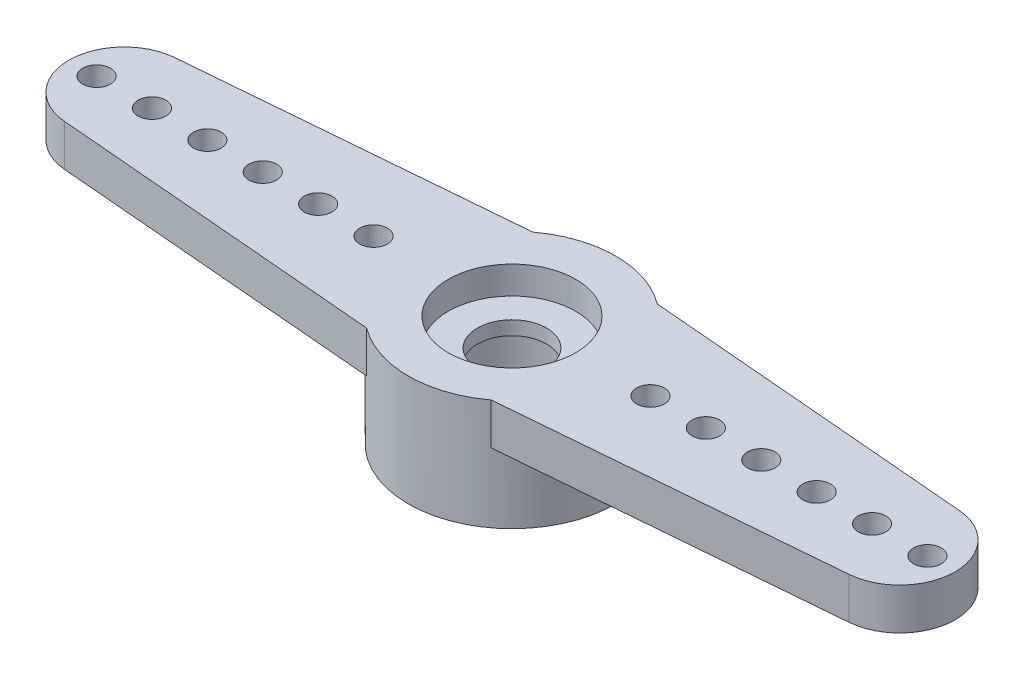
ISO-10303-21;
HEADER;
FILE_DESCRIPTION(('STEP AP214'),'2;1');
FILE_NAME('part.step','',(''),(''),'','','');
FILE_SCHEMA(('AUTOMOTIVE_DESIGN { 1 0 10303 214 1 1 1 1 }'));
ENDSEC;
DATA;
#1=APPLICATION_CONTEXT('core data for automotive mechanical design processes');
#2=APPLICATION_PROTOCOL_DEFINITION('international standard','automotive_design',2000,#1);
#3=PRODUCT_CONTEXT('',#1,'mechanical');
#4=PRODUCT('Part','Part','',(#3));
#5=PRODUCT_RELATED_PRODUCT_CATEGORY('part','',(#4));
#6=PRODUCT_DEFINITION_FORMATION('','',#4);
#7=PRODUCT_DEFINITION_CONTEXT('part definition',#1,'design');
#8=PRODUCT_DEFINITION('design','',#6,#7);
#9=PRODUCT_DEFINITION_SHAPE('','',#8);
#10=(LENGTH_UNIT() NAMED_UNIT(*) SI_UNIT(.MILLI.,.METRE.));
#11=(NAMED_UNIT(*) PLANE_ANGLE_UNIT() SI_UNIT($,.RADIAN.));
#12=(NAMED_UNIT(*) SI_UNIT($,.STERADIAN.) SOLID_ANGLE_UNIT());
#13=UNCERTAINTY_MEASURE_WITH_UNIT(LENGTH_MEASURE(1.E-05),#10,'distance_accuracy_value','');
#14=(GEOMETRIC_REPRESENTATION_CONTEXT(3) GLOBAL_UNCERTAINTY_ASSIGNED_CONTEXT((#13)) GLOBAL_UNIT_ASSIGNED_CONTEXT((#10,
#11,#12)) REPRESENTATION_CONTEXT('',''));
#15=CARTESIAN_POINT('',(0.,0.,0.));
#16=DIRECTION('',(0.,0.,1.));
#17=DIRECTION('',(1.,0.,0.));
#18=AXIS2_PLACEMENT_3D('',#15,#16,#17);
#19=CARTESIAN_POINT('',(0.,-1.5,0.));
#20=DIRECTION('',(0.,1.,0.));
#21=DIRECTION('',(0.,0.,1.));
#22=AXIS2_PLACEMENT_3D('',#19,#20,#21);
#23=CYLINDRICAL_SURFACE('',#22,1.25);
#24=CARTESIAN_POINT('',(0.,3.,0.));
#25=DIRECTION('',(0.,1.,0.));
#26=DIRECTION('',(0.,0.,1.));
#27=AXIS2_PLACEMENT_3D('',#24,#25,#26);
#28=CIRCLE('',#27,1.25);
#29=CARTESIAN_POINT('',(0.,3.,1.25));
#30=VERTEX_POINT('',#29);
#31=EDGE_CURVE('E511',#30,#30,#28,.T.);
#32=ORIENTED_EDGE('',*,*,#31,.T.);
#33=EDGE_LOOP('',(#32));
#34=FACE_BOUND('',#33,.T.);
#35=CARTESIAN_POINT('',(0.,2.5,0.));
#36=DIRECTION('',(0.,-1.,0.));
#37=DIRECTION('',(0.,0.,-1.));
#38=AXIS2_PLACEMENT_3D('',#35,#36,#37);
#39=CIRCLE('',#38,1.25);
#40=CARTESIAN_POINT('',(0.,2.5,-1.25));
#41=VERTEX_POINT('',#40);
#42=EDGE_CURVE('E37',#41,#41,#39,.F.);
#43=ORIENTED_EDGE('',*,*,#42,.F.);
#44=EDGE_LOOP('',(#43));
#45=FACE_BOUND('',#44,.T.);
#46=ADVANCED_FACE('F33',(#34,#45),#23,.F.);
#47=CARTESIAN_POINT('',(0.,4.,0.));
#48=DIRECTION('',(0.,-1.,0.));
#49=DIRECTION('',(0.,0.,-1.));
#50=AXIS2_PLACEMENT_3D('',#47,#48,#49);
#51=CYLINDRICAL_SURFACE('',#50,3.75);
#52=CARTESIAN_POINT('',(0.,4.,0.));
#53=DIRECTION('',(0.,1.,0.));
#54=DIRECTION('',(0.,0.,1.));
#55=AXIS2_PLACEMENT_3D('',#52,#53,#54);
#56=CIRCLE('',#55,3.75);
#57=CARTESIAN_POINT('',(2.25,4.,-3.));
#58=VERTEX_POINT('',#57);
#59=CARTESIAN_POINT('',(-2.25,4.,-3.));
#60=VERTEX_POINT('',#59);
#61=EDGE_CURVE('E42',#58,#60,#56,.T.);
#62=ORIENTED_EDGE('',*,*,#61,.F.);
#63=DIRECTION('',(0.,1.,0.));
#64=VECTOR('',#63,1.);
#65=CARTESIAN_POINT('',(2.25,2.5,-3.));
#66=LINE('',#65,#64);
#67=CARTESIAN_POINT('',(2.25,2.5,-3.));
#68=VERTEX_POINT('',#67);
#69=EDGE_CURVE('E125',#68,#58,#66,.T.);
#70=ORIENTED_EDGE('',*,*,#69,.F.);
#71=CARTESIAN_POINT('',(0.,2.5,0.));
#72=DIRECTION('',(0.,-1.,0.));
#73=DIRECTION('',(0.,0.,-1.));
#74=AXIS2_PLACEMENT_3D('',#71,#72,#73);
#75=CIRCLE('',#74,3.75);
#76=CARTESIAN_POINT('',(2.25,2.5,3.));
#77=VERTEX_POINT('',#76);
#78=EDGE_CURVE('E117',#68,#77,#75,.T.);
#79=ORIENTED_EDGE('',*,*,#78,.T.);
#80=DIRECTION('',(0.,1.,0.));
#81=VECTOR('',#80,1.);
#82=CARTESIAN_POINT('',(2.25,2.5,3.));
#83=LINE('',#82,#81);
#84=CARTESIAN_POINT('',(2.25,4.,3.));
#85=VERTEX_POINT('',#84);
#86=EDGE_CURVE('E101',#77,#85,#83,.T.);
#87=ORIENTED_EDGE('',*,*,#86,.T.);
#88=CARTESIAN_POINT('',(-2.25,4.,3.));
#89=VERTEX_POINT('',#88);
#90=EDGE_CURVE('E11',#89,#85,#56,.T.);
#91=ORIENTED_EDGE('',*,*,#90,.F.);
#92=DIRECTION('',(0.,1.,0.));
#93=VECTOR('',#92,1.);
#94=CARTESIAN_POINT('',(-2.25,2.5,3.));
#95=LINE('',#94,#93);
#96=CARTESIAN_POINT('',(-2.25,2.5,3.));
#97=VERTEX_POINT('',#96);
#98=EDGE_CURVE('E203',#97,#89,#95,.T.);
#99=ORIENTED_EDGE('',*,*,#98,.F.);
#100=CARTESIAN_POINT('',(0.,2.5,0.));
#101=DIRECTION('',(0.,-1.,0.));
#102=DIRECTION('',(0.,0.,1.));
#103=AXIS2_PLACEMENT_3D('',#100,#101,#102);
#104=CIRCLE('',#103,3.75);
#105=CARTESIAN_POINT('',(-2.25,2.5,-3.));
#106=VERTEX_POINT('',#105);
#107=EDGE_CURVE('E186',#97,#106,#104,.T.);
#108=ORIENTED_EDGE('',*,*,#107,.T.);
#109=DIRECTION('',(0.,1.,0.));
#110=VECTOR('',#109,1.);
#111=CARTESIAN_POINT('',(-2.25,2.5,-3.));
#112=LINE('',#111,#110);
#113=EDGE_CURVE('E200',#106,#60,#112,.T.);
#114=ORIENTED_EDGE('',*,*,#113,.T.);
#115=EDGE_LOOP('',(#62,#70,#79,#87,#91,#99,#108,#114));
#116=FACE_BOUND('',#115,.T.);
#117=CARTESIAN_POINT('',(0.,0.,0.));
#118=DIRECTION('',(0.,1.,0.));
#119=DIRECTION('',(0.,0.,1.));
#120=AXIS2_PLACEMENT_3D('',#117,#118,#119);
#121=CIRCLE('',#120,3.75);
#122=CARTESIAN_POINT('',(0.,0.,3.75));
#123=VERTEX_POINT('',#122);
#124=EDGE_CURVE('E209',#123,#123,#121,.T.);
#125=ORIENTED_EDGE('',*,*,#124,.T.);
#126=EDGE_LOOP('',(#125));
#127=FACE_BOUND('',#126,.T.);
#128=ADVANCED_FACE('F35',(#116,#127),#51,.T.);
#129=CARTESIAN_POINT('',(0.,4.,0.));
#130=DIRECTION('',(0.,1.,0.));
#131=DIRECTION('',(0.,0.,1.));
#132=AXIS2_PLACEMENT_3D('',#129,#130,#131);
#133=PLANE('',#132);
#134=CARTESIAN_POINT('',(0.,4.,0.));
#135=DIRECTION('',(0.,1.,0.));
#136=DIRECTION('',(0.,0.,1.));
#137=AXIS2_PLACEMENT_3D('',#134,#135,#136);
#138=CIRCLE('',#137,2.3);
#139=CARTESIAN_POINT('',(0.,4.,2.3));
#140=VERTEX_POINT('',#139);
#141=EDGE_CURVE('E199',#140,#140,#138,.T.);
#142=ORIENTED_EDGE('',*,*,#141,.F.);
#143=EDGE_LOOP('',(#142));
#144=FACE_BOUND('',#143,.T.);
#145=ORIENTED_EDGE('',*,*,#90,.T.);
#146=DIRECTION('',(0.996448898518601,0.,-0.0841997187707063));
#147=VECTOR('',#146,1.);
#148=CARTESIAN_POINT('',(14.1683994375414,4.,1.9928977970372));
#149=LINE('',#148,#147);
#150=CARTESIAN_POINT('',(14.1683994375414,4.,1.99289779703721));
#151=VERTEX_POINT('',#150);
#152=EDGE_CURVE('E106',#85,#151,#149,.T.);
#153=ORIENTED_EDGE('',*,*,#152,.T.);
#154=CARTESIAN_POINT('',(14.,4.,0.));
#155=DIRECTION('',(0.,1.,0.));
#156=DIRECTION('',(0.,0.,-1.));
#157=AXIS2_PLACEMENT_3D('',#154,#155,#156);
#158=CIRCLE('',#157,2.);
#159=CARTESIAN_POINT('',(14.1683994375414,4.,-1.9928977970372));
#160=VERTEX_POINT('',#159);
#161=EDGE_CURVE('E127',#151,#160,#158,.T.);
#162=ORIENTED_EDGE('',*,*,#161,.T.);
#163=DIRECTION('',(-0.996448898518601,0.,-0.0841997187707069));
#164=VECTOR('',#163,1.);
#165=CARTESIAN_POINT('',(14.1683994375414,4.,-1.9928977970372));
#166=LINE('',#165,#164);
#167=EDGE_CURVE('E50',#160,#58,#166,.T.);
#168=ORIENTED_EDGE('',*,*,#167,.T.);
#169=ORIENTED_EDGE('',*,*,#61,.T.);
#170=DIRECTION('',(-0.996448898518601,0.,0.0841997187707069));
#171=VECTOR('',#170,1.);
#172=CARTESIAN_POINT('',(-14.1683994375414,4.,-1.9928977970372));
#173=LINE('',#172,#171);
#174=CARTESIAN_POINT('',(-14.1683994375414,4.,-1.9928977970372));
#175=VERTEX_POINT('',#174);
#176=EDGE_CURVE('E183',#60,#175,#173,.T.);
#177=ORIENTED_EDGE('',*,*,#176,.T.);
#178=CARTESIAN_POINT('',(-14.,4.,0.));
#179=DIRECTION('',(0.,1.,0.));
#180=DIRECTION('',(0.,0.,1.));
#181=AXIS2_PLACEMENT_3D('',#178,#179,#180);
#182=CIRCLE('',#181,2.);
#183=CARTESIAN_POINT('',(-14.1683994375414,4.,1.9928977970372));
#184=VERTEX_POINT('',#183);
#185=EDGE_CURVE('E176',#175,#184,#182,.T.);
#186=ORIENTED_EDGE('',*,*,#185,.T.);
#187=DIRECTION('',(0.996448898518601,0.,0.0841997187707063));
#188=VECTOR('',#187,1.);
#189=CARTESIAN_POINT('',(-14.1683994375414,4.,1.9928977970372));
#190=LINE('',#189,#188);
#191=EDGE_CURVE('E56',#184,#89,#190,.T.);
#192=ORIENTED_EDGE('',*,*,#191,.T.);
#193=EDGE_LOOP('',(#145,#153,#162,#168,#169,#177,#186,#192));
#194=FACE_BOUND('',#193,.T.);
#195=CARTESIAN_POINT('',(-5.,4.,0.));
#196=DIRECTION('',(0.,1.,0.));
#197=DIRECTION('',(0.,0.,1.));
#198=AXIS2_PLACEMENT_3D('',#195,#196,#197);
#199=CIRCLE('',#198,0.500000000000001);
#200=CARTESIAN_POINT('',(-5.,4.,0.500000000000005));
#201=VERTEX_POINT('',#200);
#202=EDGE_CURVE('E139',#201,#201,#199,.T.);
#203=ORIENTED_EDGE('',*,*,#202,.F.);
#204=EDGE_LOOP('',(#203));
#205=FACE_BOUND('',#204,.T.);
#206=CARTESIAN_POINT('',(-7.,4.,0.));
#207=DIRECTION('',(0.,1.,0.));
#208=DIRECTION('',(0.,0.,1.));
#209=AXIS2_PLACEMENT_3D('',#206,#207,#208);
#210=CIRCLE('',#209,0.500000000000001);
#211=CARTESIAN_POINT('',(-7.,4.,0.500000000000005));
#212=VERTEX_POINT('',#211);
#213=EDGE_CURVE('E146',#212,#212,#210,.T.);
#214=ORIENTED_EDGE('',*,*,#213,.F.);
#215=EDGE_LOOP('',(#214));
#216=FACE_BOUND('',#215,.T.);
#217=CARTESIAN_POINT('',(-9.,4.,0.));
#218=DIRECTION('',(0.,1.,0.));
#219=DIRECTION('',(0.,0.,1.));
#220=AXIS2_PLACEMENT_3D('',#217,#218,#219);
#221=CIRCLE('',#220,0.500000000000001);
#222=CARTESIAN_POINT('',(-9.,4.,0.500000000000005));
#223=VERTEX_POINT('',#222);
#224=EDGE_CURVE('E152',#223,#223,#221,.T.);
#225=ORIENTED_EDGE('',*,*,#224,.F.);
#226=EDGE_LOOP('',(#225));
#227=FACE_BOUND('',#226,.T.);
#228=CARTESIAN_POINT('',(-11.,4.,0.));
#229=DIRECTION('',(0.,1.,0.));
#230=DIRECTION('',(0.,0.,1.));
#231=AXIS2_PLACEMENT_3D('',#228,#229,#230);
#232=CIRCLE('',#231,0.500000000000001);
#233=CARTESIAN_POINT('',(-11.,4.,0.500000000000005));
#234=VERTEX_POINT('',#233);
#235=EDGE_CURVE('E158',#234,#234,#232,.T.);
#236=ORIENTED_EDGE('',*,*,#235,.F.);
#237=EDGE_LOOP('',(#236));
#238=FACE_BOUND('',#237,.T.);
#239=CARTESIAN_POINT('',(-13.,4.,0.));
#240=DIRECTION('',(0.,1.,0.));
#241=DIRECTION('',(0.,0.,1.));
#242=AXIS2_PLACEMENT_3D('',#239,#240,#241);
#243=CIRCLE('',#242,0.500000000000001);
#244=CARTESIAN_POINT('',(-13.,4.,0.500000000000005));
#245=VERTEX_POINT('',#244);
#246=EDGE_CURVE('E164',#245,#245,#243,.T.);
#247=ORIENTED_EDGE('',*,*,#246,.F.);
#248=EDGE_LOOP('',(#247));
#249=FACE_BOUND('',#248,.T.);
#250=CARTESIAN_POINT('',(-15.,4.,0.));
#251=DIRECTION('',(0.,1.,0.));
#252=DIRECTION('',(0.,0.,1.));
#253=AXIS2_PLACEMENT_3D('',#250,#251,#252);
#254=CIRCLE('',#253,0.500000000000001);
#255=CARTESIAN_POINT('',(-15.,4.,0.500000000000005));
#256=VERTEX_POINT('',#255);
#257=EDGE_CURVE('E170',#256,#256,#254,.T.);
#258=ORIENTED_EDGE('',*,*,#257,.F.);
#259=EDGE_LOOP('',(#258));
#260=FACE_BOUND('',#259,.T.);
#261=CARTESIAN_POINT('',(13.,4.,0.));
#262=DIRECTION('',(0.,1.,0.));
#263=DIRECTION('',(0.,0.,-1.));
#264=AXIS2_PLACEMENT_3D('',#261,#262,#263);
#265=CIRCLE('',#264,0.500000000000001);
#266=CARTESIAN_POINT('',(13.,4.,-0.499999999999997));
#267=VERTEX_POINT('',#266);
#268=EDGE_CURVE('E513',#267,#267,#265,.T.);
#269=ORIENTED_EDGE('',*,*,#268,.F.);
#270=EDGE_LOOP('',(#269));
#271=FACE_BOUND('',#270,.T.);
#272=CARTESIAN_POINT('',(11.,4.,0.));
#273=DIRECTION('',(0.,1.,0.));
#274=DIRECTION('',(0.,0.,-1.));
#275=AXIS2_PLACEMENT_3D('',#272,#273,#274);
#276=CIRCLE('',#275,0.500000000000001);
#277=CARTESIAN_POINT('',(11.,4.,-0.499999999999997));
#278=VERTEX_POINT('',#277);
#279=EDGE_CURVE('E517',#278,#278,#276,.T.);
#280=ORIENTED_EDGE('',*,*,#279,.F.);
#281=EDGE_LOOP('',(#280));
#282=FACE_BOUND('',#281,.T.);
#283=CARTESIAN_POINT('',(9.,4.,0.));
#284=DIRECTION('',(0.,1.,0.));
#285=DIRECTION('',(0.,0.,-1.));
#286=AXIS2_PLACEMENT_3D('',#283,#284,#285);
#287=CIRCLE('',#286,0.500000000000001);
#288=CARTESIAN_POINT('',(9.,4.,-0.499999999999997));
#289=VERTEX_POINT('',#288);
#290=EDGE_CURVE('E523',#289,#289,#287,.T.);
#291=ORIENTED_EDGE('',*,*,#290,.F.);
#292=EDGE_LOOP('',(#291));
#293=FACE_BOUND('',#292,.T.);
#294=CARTESIAN_POINT('',(7.,4.,0.));
#295=DIRECTION('',(0.,1.,0.));
#296=DIRECTION('',(0.,0.,-1.));
#297=AXIS2_PLACEMENT_3D('',#294,#295,#296);
#298=CIRCLE('',#297,0.500000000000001);
#299=CARTESIAN_POINT('',(7.,4.,-0.499999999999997));
#300=VERTEX_POINT('',#299);
#301=EDGE_CURVE('E529',#300,#300,#298,.T.);
#302=ORIENTED_EDGE('',*,*,#301,.F.);
#303=EDGE_LOOP('',(#302));
#304=FACE_BOUND('',#303,.T.);
#305=CARTESIAN_POINT('',(5.,4.,0.));
#306=DIRECTION('',(0.,1.,0.));
#307=DIRECTION('',(0.,0.,-1.));
#308=AXIS2_PLACEMENT_3D('',#305,#306,#307);
#309=CIRCLE('',#308,0.500000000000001);
#310=CARTESIAN_POINT('',(5.,4.,-0.499999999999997));
#311=VERTEX_POINT('',#310);
#312=EDGE_CURVE('E535',#311,#311,#309,.T.);
#313=ORIENTED_EDGE('',*,*,#312,.F.);
#314=EDGE_LOOP('',(#313));
#315=FACE_BOUND('',#314,.T.);
#316=CARTESIAN_POINT('',(15.,4.,0.));
#317=DIRECTION('',(0.,1.,0.));
#318=DIRECTION('',(0.,0.,-1.));
#319=AXIS2_PLACEMENT_3D('',#316,#317,#318);
#320=CIRCLE('',#319,0.500000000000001);
#321=CARTESIAN_POINT('',(15.,4.,-0.499999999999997));
#322=VERTEX_POINT('',#321);
#323=EDGE_CURVE('E130',#322,#322,#320,.T.);
#324=ORIENTED_EDGE('',*,*,#323,.F.);
#325=EDGE_LOOP('',(#324));
#326=FACE_BOUND('',#325,.T.);
#327=ADVANCED_FACE('F214',(#144,#194,#205,#216,#227,#238,#249,#260,#271,#282,#293,#304,#315,
#326),#133,.T.);
#328=CARTESIAN_POINT('',(0.,0.,0.));
#329=DIRECTION('',(0.,1.,0.));
#330=DIRECTION('',(0.,0.,1.));
#331=AXIS2_PLACEMENT_3D('',#328,#329,#330);
#332=PLANE('',#331);
#333=CARTESIAN_POINT('',(0.,0.,0.));
#334=DIRECTION('',(0.,-1.,0.));
#335=DIRECTION('',(0.,0.,-1.));
#336=AXIS2_PLACEMENT_3D('',#333,#334,#335);
#337=CIRCLE('',#336,2.3);
#338=CARTESIAN_POINT('',(0.,0.,-2.3));
#339=VERTEX_POINT('',#338);
#340=EDGE_CURVE('E504',#339,#339,#337,.T.);
#341=ORIENTED_EDGE('',*,*,#340,.F.);
#342=EDGE_LOOP('',(#341));
#343=FACE_BOUND('',#342,.T.);
#344=ORIENTED_EDGE('',*,*,#124,.F.);
#345=EDGE_LOOP('',(#344));
#346=FACE_BOUND('',#345,.T.);
#347=ADVANCED_FACE('F464',(#343,#346),#332,.F.);
#348=CARTESIAN_POINT('',(0.,3.,0.));
#349=DIRECTION('',(0.,1.,0.));
#350=DIRECTION('',(0.,0.,1.));
#351=AXIS2_PLACEMENT_3D('',#348,#349,#350);
#352=CYLINDRICAL_SURFACE('',#351,2.3);
#353=CARTESIAN_POINT('',(0.,3.,0.));
#354=DIRECTION('',(0.,1.,0.));
#355=DIRECTION('',(0.,0.,1.));
#356=AXIS2_PLACEMENT_3D('',#353,#354,#355);
#357=CIRCLE('',#356,2.3);
#358=CARTESIAN_POINT('',(0.,3.,2.3));
#359=VERTEX_POINT('',#358);
#360=EDGE_CURVE('E206',#359,#359,#357,.T.);
#361=ORIENTED_EDGE('',*,*,#360,.F.);
#362=EDGE_LOOP('',(#361));
#363=FACE_BOUND('',#362,.T.);
#364=ORIENTED_EDGE('',*,*,#141,.T.);
#365=EDGE_LOOP('',(#364));
#366=FACE_BOUND('',#365,.T.);
#367=ADVANCED_FACE('F237',(#363,#366),#352,.F.);
#368=CARTESIAN_POINT('',(0.,3.,0.));
#369=DIRECTION('',(0.,1.,0.));
#370=DIRECTION('',(0.,0.,1.));
#371=AXIS2_PLACEMENT_3D('',#368,#369,#370);
#372=PLANE('',#371);
#373=ORIENTED_EDGE('',*,*,#31,.F.);
#374=EDGE_LOOP('',(#373));
#375=FACE_BOUND('',#374,.T.);
#376=ORIENTED_EDGE('',*,*,#360,.T.);
#377=EDGE_LOOP('',(#376));
#378=FACE_BOUND('',#377,.T.);
#379=ADVANCED_FACE('F230',(#375,#378),#372,.T.);
#380=CARTESIAN_POINT('',(-14.,2.5,0.));
#381=DIRECTION('',(0.,1.,0.));
#382=DIRECTION('',(0.,0.,1.));
#383=AXIS2_PLACEMENT_3D('',#380,#381,#382);
#384=CYLINDRICAL_SURFACE('',#383,2.);
#385=ORIENTED_EDGE('',*,*,#185,.F.);
#386=DIRECTION('',(0.,1.,0.));
#387=VECTOR('',#386,1.);
#388=CARTESIAN_POINT('',(-14.1683994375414,2.5,-1.9928977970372));
#389=LINE('',#388,#387);
#390=CARTESIAN_POINT('',(-14.1683994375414,2.5,-1.9928977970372));
#391=VERTEX_POINT('',#390);
#392=EDGE_CURVE('E197',#391,#175,#389,.T.);
#393=ORIENTED_EDGE('',*,*,#392,.F.);
#394=CARTESIAN_POINT('',(-14.,2.5,0.));
#395=DIRECTION('',(0.,1.,0.));
#396=DIRECTION('',(0.,0.,1.));
#397=AXIS2_PLACEMENT_3D('',#394,#395,#396);
#398=CIRCLE('',#397,2.);
#399=CARTESIAN_POINT('',(-14.1683994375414,2.5,1.9928977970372));
#400=VERTEX_POINT('',#399);
#401=EDGE_CURVE('E179',#391,#400,#398,.T.);
#402=ORIENTED_EDGE('',*,*,#401,.T.);
#403=DIRECTION('',(0.,1.,0.));
#404=VECTOR('',#403,1.);
#405=CARTESIAN_POINT('',(-14.1683994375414,2.5,1.9928977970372));
#406=LINE('',#405,#404);
#407=EDGE_CURVE('E192',#400,#184,#406,.T.);
#408=ORIENTED_EDGE('',*,*,#407,.T.);
#409=EDGE_LOOP('',(#385,#393,#402,#408));
#410=FACE_BOUND('',#409,.T.);
#411=ADVANCED_FACE('F228',(#410),#384,.T.);
#412=CARTESIAN_POINT('',(-14.1683994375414,2.5,-1.9928977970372));
#413=DIRECTION('',(-0.0841997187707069,0.,-0.996448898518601));
#414=DIRECTION('',(-0.996448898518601,0.,0.0841997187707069));
#415=AXIS2_PLACEMENT_3D('',#412,#413,#414);
#416=PLANE('',#415);
#417=ORIENTED_EDGE('',*,*,#176,.F.);
#418=ORIENTED_EDGE('',*,*,#113,.F.);
#419=DIRECTION('',(-0.996448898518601,0.,0.0841997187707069));
#420=VECTOR('',#419,1.);
#421=CARTESIAN_POINT('',(-14.1683994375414,2.5,-1.9928977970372));
#422=LINE('',#421,#420);
#423=EDGE_CURVE('E189',#106,#391,#422,.T.);
#424=ORIENTED_EDGE('',*,*,#423,.T.);
#425=ORIENTED_EDGE('',*,*,#392,.T.);
#426=EDGE_LOOP('',(#417,#418,#424,#425));
#427=FACE_BOUND('',#426,.T.);
#428=ADVANCED_FACE('F217',(#427),#416,.T.);
#429=CARTESIAN_POINT('',(-14.1683994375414,2.5,1.9928977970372));
#430=DIRECTION('',(-0.0841997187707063,0.,0.996448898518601));
#431=DIRECTION('',(0.996448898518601,0.,0.0841997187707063));
#432=AXIS2_PLACEMENT_3D('',#429,#430,#431);
#433=PLANE('',#432);
#434=ORIENTED_EDGE('',*,*,#191,.F.);
#435=ORIENTED_EDGE('',*,*,#407,.F.);
#436=DIRECTION('',(0.996448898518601,0.,0.0841997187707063));
#437=VECTOR('',#436,1.);
#438=CARTESIAN_POINT('',(-14.1683994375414,2.5,1.9928977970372));
#439=LINE('',#438,#437);
#440=EDGE_CURVE('E182',#400,#97,#439,.T.);
#441=ORIENTED_EDGE('',*,*,#440,.T.);
#442=ORIENTED_EDGE('',*,*,#98,.T.);
#443=EDGE_LOOP('',(#434,#435,#441,#442));
#444=FACE_BOUND('',#443,.T.);
#445=ADVANCED_FACE('F226',(#444),#433,.T.);
#446=CARTESIAN_POINT('',(-14.,2.5,0.));
#447=DIRECTION('',(0.,1.,0.));
#448=DIRECTION('',(0.,0.,1.));
#449=AXIS2_PLACEMENT_3D('',#446,#447,#448);
#450=PLANE('',#449);
#451=CARTESIAN_POINT('',(-5.,2.5,0.));
#452=DIRECTION('',(0.,1.,0.));
#453=DIRECTION('',(0.,0.,1.));
#454=AXIS2_PLACEMENT_3D('',#451,#452,#453);
#455=CIRCLE('',#454,0.500000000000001);
#456=CARTESIAN_POINT('',(-5.,2.5,0.500000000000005));
#457=VERTEX_POINT('',#456);
#458=EDGE_CURVE('E143',#457,#457,#455,.T.);
#459=ORIENTED_EDGE('',*,*,#458,.T.);
#460=EDGE_LOOP('',(#459));
#461=FACE_BOUND('',#460,.T.);
#462=CARTESIAN_POINT('',(-7.,2.5,0.));
#463=DIRECTION('',(0.,1.,0.));
#464=DIRECTION('',(0.,0.,1.));
#465=AXIS2_PLACEMENT_3D('',#462,#463,#464);
#466=CIRCLE('',#465,0.500000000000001);
#467=CARTESIAN_POINT('',(-7.,2.5,0.500000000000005));
#468=VERTEX_POINT('',#467);
#469=EDGE_CURVE('E149',#468,#468,#466,.T.);
#470=ORIENTED_EDGE('',*,*,#469,.T.);
#471=EDGE_LOOP('',(#470));
#472=FACE_BOUND('',#471,.T.);
#473=CARTESIAN_POINT('',(-9.,2.5,0.));
#474=DIRECTION('',(0.,1.,0.));
#475=DIRECTION('',(0.,0.,1.));
#476=AXIS2_PLACEMENT_3D('',#473,#474,#475);
#477=CIRCLE('',#476,0.500000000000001);
#478=CARTESIAN_POINT('',(-9.,2.5,0.500000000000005));
#479=VERTEX_POINT('',#478);
#480=EDGE_CURVE('E155',#479,#479,#477,.T.);
#481=ORIENTED_EDGE('',*,*,#480,.T.);
#482=EDGE_LOOP('',(#481));
#483=FACE_BOUND('',#482,.T.);
#484=CARTESIAN_POINT('',(-11.,2.5,0.));
#485=DIRECTION('',(0.,1.,0.));
#486=DIRECTION('',(0.,0.,1.));
#487=AXIS2_PLACEMENT_3D('',#484,#485,#486);
#488=CIRCLE('',#487,0.500000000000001);
#489=CARTESIAN_POINT('',(-11.,2.5,0.500000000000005));
#490=VERTEX_POINT('',#489);
#491=EDGE_CURVE('E161',#490,#490,#488,.T.);
#492=ORIENTED_EDGE('',*,*,#491,.T.);
#493=EDGE_LOOP('',(#492));
#494=FACE_BOUND('',#493,.T.);
#495=CARTESIAN_POINT('',(-13.,2.5,0.));
#496=DIRECTION('',(0.,1.,0.));
#497=DIRECTION('',(0.,0.,1.));
#498=AXIS2_PLACEMENT_3D('',#495,#496,#497);
#499=CIRCLE('',#498,0.500000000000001);
#500=CARTESIAN_POINT('',(-13.,2.5,0.500000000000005));
#501=VERTEX_POINT('',#500);
#502=EDGE_CURVE('E167',#501,#501,#499,.T.);
#503=ORIENTED_EDGE('',*,*,#502,.T.);
#504=EDGE_LOOP('',(#503));
#505=FACE_BOUND('',#504,.T.);
#506=CARTESIAN_POINT('',(-15.,2.5,0.));
#507=DIRECTION('',(0.,1.,0.));
#508=DIRECTION('',(0.,0.,1.));
#509=AXIS2_PLACEMENT_3D('',#506,#507,#508);
#510=CIRCLE('',#509,0.500000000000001);
#511=CARTESIAN_POINT('',(-15.,2.5,0.500000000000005));
#512=VERTEX_POINT('',#511);
#513=EDGE_CURVE('E173',#512,#512,#510,.T.);
#514=ORIENTED_EDGE('',*,*,#513,.T.);
#515=EDGE_LOOP('',(#514));
#516=FACE_BOUND('',#515,.T.);
#517=ORIENTED_EDGE('',*,*,#401,.F.);
#518=ORIENTED_EDGE('',*,*,#423,.F.);
#519=ORIENTED_EDGE('',*,*,#107,.F.);
#520=ORIENTED_EDGE('',*,*,#440,.F.);
#521=EDGE_LOOP('',(#517,#518,#519,#520));
#522=FACE_BOUND('',#521,.T.);
#523=ADVANCED_FACE('F224',(#461,#472,#483,#494,#505,#516,#522),#450,.F.);
#524=CARTESIAN_POINT('',(-15.,2.5,0.));
#525=DIRECTION('',(0.,1.,0.));
#526=DIRECTION('',(0.,0.,1.));
#527=AXIS2_PLACEMENT_3D('',#524,#525,#526);
#528=CYLINDRICAL_SURFACE('',#527,0.500000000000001);
#529=ORIENTED_EDGE('',*,*,#513,.F.);
#530=EDGE_LOOP('',(#529));
#531=FACE_BOUND('',#530,.T.);
#532=ORIENTED_EDGE('',*,*,#257,.T.);
#533=EDGE_LOOP('',(#532));
#534=FACE_BOUND('',#533,.T.);
#535=ADVANCED_FACE('F310',(#531,#534),#528,.F.);
#536=CARTESIAN_POINT('',(-13.,2.5,0.));
#537=DIRECTION('',(0.,1.,0.));
#538=DIRECTION('',(0.,0.,1.));
#539=AXIS2_PLACEMENT_3D('',#536,#537,#538);
#540=CYLINDRICAL_SURFACE('',#539,0.500000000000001);
#541=ORIENTED_EDGE('',*,*,#502,.F.);
#542=EDGE_LOOP('',(#541));
#543=FACE_BOUND('',#542,.T.);
#544=ORIENTED_EDGE('',*,*,#246,.T.);
#545=EDGE_LOOP('',(#544));
#546=FACE_BOUND('',#545,.T.);
#547=ADVANCED_FACE('F306',(#543,#546),#540,.F.);
#548=CARTESIAN_POINT('',(-11.,2.5,0.));
#549=DIRECTION('',(0.,1.,0.));
#550=DIRECTION('',(0.,0.,1.));
#551=AXIS2_PLACEMENT_3D('',#548,#549,#550);
#552=CYLINDRICAL_SURFACE('',#551,0.500000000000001);
#553=ORIENTED_EDGE('',*,*,#491,.F.);
#554=EDGE_LOOP('',(#553));
#555=FACE_BOUND('',#554,.T.);
#556=ORIENTED_EDGE('',*,*,#235,.T.);
#557=EDGE_LOOP('',(#556));
#558=FACE_BOUND('',#557,.T.);
#559=ADVANCED_FACE('F302',(#555,#558),#552,.F.);
#560=CARTESIAN_POINT('',(-9.,2.5,0.));
#561=DIRECTION('',(0.,1.,0.));
#562=DIRECTION('',(0.,0.,1.));
#563=AXIS2_PLACEMENT_3D('',#560,#561,#562);
#564=CYLINDRICAL_SURFACE('',#563,0.500000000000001);
#565=ORIENTED_EDGE('',*,*,#480,.F.);
#566=EDGE_LOOP('',(#565));
#567=FACE_BOUND('',#566,.T.);
#568=ORIENTED_EDGE('',*,*,#224,.T.);
#569=EDGE_LOOP('',(#568));
#570=FACE_BOUND('',#569,.T.);
#571=ADVANCED_FACE('F298',(#567,#570),#564,.F.);
#572=CARTESIAN_POINT('',(-7.,2.5,0.));
#573=DIRECTION('',(0.,1.,0.));
#574=DIRECTION('',(0.,0.,1.));
#575=AXIS2_PLACEMENT_3D('',#572,#573,#574);
#576=CYLINDRICAL_SURFACE('',#575,0.500000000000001);
#577=ORIENTED_EDGE('',*,*,#469,.F.);
#578=EDGE_LOOP('',(#577));
#579=FACE_BOUND('',#578,.T.);
#580=ORIENTED_EDGE('',*,*,#213,.T.);
#581=EDGE_LOOP('',(#580));
#582=FACE_BOUND('',#581,.T.);
#583=ADVANCED_FACE('F294',(#579,#582),#576,.F.);
#584=CARTESIAN_POINT('',(-5.,2.5,0.));
#585=DIRECTION('',(0.,1.,0.));
#586=DIRECTION('',(0.,0.,1.));
#587=AXIS2_PLACEMENT_3D('',#584,#585,#586);
#588=CYLINDRICAL_SURFACE('',#587,0.500000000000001);
#589=ORIENTED_EDGE('',*,*,#458,.F.);
#590=EDGE_LOOP('',(#589));
#591=FACE_BOUND('',#590,.T.);
#592=ORIENTED_EDGE('',*,*,#202,.T.);
#593=EDGE_LOOP('',(#592));
#594=FACE_BOUND('',#593,.T.);
#595=ADVANCED_FACE('F285',(#591,#594),#588,.F.);
#596=CARTESIAN_POINT('',(14.1683994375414,2.5,-1.9928977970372));
#597=DIRECTION('',(0.0841997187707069,0.,-0.996448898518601));
#598=DIRECTION('',(-0.996448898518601,0.,-0.0841997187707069));
#599=AXIS2_PLACEMENT_3D('',#596,#597,#598);
#600=PLANE('',#599);
#601=ORIENTED_EDGE('',*,*,#167,.F.);
#602=DIRECTION('',(0.,1.,0.));
#603=VECTOR('',#602,1.);
#604=CARTESIAN_POINT('',(14.1683994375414,2.5,-1.9928977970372));
#605=LINE('',#604,#603);
#606=CARTESIAN_POINT('',(14.1683994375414,2.5,-1.9928977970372));
#607=VERTEX_POINT('',#606);
#608=EDGE_CURVE('E140',#607,#160,#605,.T.);
#609=ORIENTED_EDGE('',*,*,#608,.F.);
#610=DIRECTION('',(-0.996448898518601,0.,-0.0841997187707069));
#611=VECTOR('',#610,1.);
#612=CARTESIAN_POINT('',(14.1683994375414,2.5,-1.9928977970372));
#613=LINE('',#612,#611);
#614=EDGE_CURVE('E111',#607,#68,#613,.T.);
#615=ORIENTED_EDGE('',*,*,#614,.T.);
#616=ORIENTED_EDGE('',*,*,#69,.T.);
#617=EDGE_LOOP('',(#601,#609,#615,#616));
#618=FACE_BOUND('',#617,.T.);
#619=ADVANCED_FACE('F281',(#618),#600,.T.);
#620=CARTESIAN_POINT('',(14.,2.5,0.));
#621=DIRECTION('',(0.,1.,0.));
#622=DIRECTION('',(0.,0.,1.));
#623=AXIS2_PLACEMENT_3D('',#620,#621,#622);
#624=CYLINDRICAL_SURFACE('',#623,2.);
#625=ORIENTED_EDGE('',*,*,#161,.F.);
#626=DIRECTION('',(0.,1.,0.));
#627=VECTOR('',#626,1.);
#628=CARTESIAN_POINT('',(14.1683994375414,2.5,1.99289779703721));
#629=LINE('',#628,#627);
#630=CARTESIAN_POINT('',(14.1683994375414,2.5,1.99289779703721));
#631=VERTEX_POINT('',#630);
#632=EDGE_CURVE('E110',#631,#151,#629,.T.);
#633=ORIENTED_EDGE('',*,*,#632,.F.);
#634=CARTESIAN_POINT('',(14.,2.5,0.));
#635=DIRECTION('',(0.,1.,0.));
#636=DIRECTION('',(0.,0.,-1.));
#637=AXIS2_PLACEMENT_3D('',#634,#635,#636);
#638=CIRCLE('',#637,2.);
#639=EDGE_CURVE('E120',#631,#607,#638,.T.);
#640=ORIENTED_EDGE('',*,*,#639,.T.);
#641=ORIENTED_EDGE('',*,*,#608,.T.);
#642=EDGE_LOOP('',(#625,#633,#640,#641));
#643=FACE_BOUND('',#642,.T.);
#644=ADVANCED_FACE('F284',(#643),#624,.T.);
#645=CARTESIAN_POINT('',(14.1683994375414,2.5,1.9928977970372));
#646=DIRECTION('',(0.0841997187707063,0.,0.996448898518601));
#647=DIRECTION('',(0.996448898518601,0.,-0.0841997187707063));
#648=AXIS2_PLACEMENT_3D('',#645,#646,#647);
#649=PLANE('',#648);
#650=ORIENTED_EDGE('',*,*,#152,.F.);
#651=ORIENTED_EDGE('',*,*,#86,.F.);
#652=DIRECTION('',(0.996448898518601,0.,-0.0841997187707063));
#653=VECTOR('',#652,1.);
#654=CARTESIAN_POINT('',(14.1683994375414,2.5,1.9928977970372));
#655=LINE('',#654,#653);
#656=EDGE_CURVE('E104',#77,#631,#655,.T.);
#657=ORIENTED_EDGE('',*,*,#656,.T.);
#658=ORIENTED_EDGE('',*,*,#632,.T.);
#659=EDGE_LOOP('',(#650,#651,#657,#658));
#660=FACE_BOUND('',#659,.T.);
#661=ADVANCED_FACE('F103',(#660),#649,.T.);
#662=CARTESIAN_POINT('',(0.,2.5,0.));
#663=DIRECTION('',(0.,-1.,0.));
#664=DIRECTION('',(0.,0.,-1.));
#665=AXIS2_PLACEMENT_3D('',#662,#663,#664);
#666=PLANE('',#665);
#667=CARTESIAN_POINT('',(13.,2.5,0.));
#668=DIRECTION('',(0.,1.,0.));
#669=DIRECTION('',(0.,0.,-1.));
#670=AXIS2_PLACEMENT_3D('',#667,#668,#669);
#671=CIRCLE('',#670,0.500000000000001);
#672=CARTESIAN_POINT('',(13.,2.5,-0.499999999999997));
#673=VERTEX_POINT('',#672);
#674=EDGE_CURVE('E514',#673,#673,#671,.T.);
#675=ORIENTED_EDGE('',*,*,#674,.T.);
#676=EDGE_LOOP('',(#675));
#677=FACE_BOUND('',#676,.T.);
#678=CARTESIAN_POINT('',(11.,2.5,0.));
#679=DIRECTION('',(0.,1.,0.));
#680=DIRECTION('',(0.,0.,-1.));
#681=AXIS2_PLACEMENT_3D('',#678,#679,#680);
#682=CIRCLE('',#681,0.500000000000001);
#683=CARTESIAN_POINT('',(11.,2.5,-0.499999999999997));
#684=VERTEX_POINT('',#683);
#685=EDGE_CURVE('E520',#684,#684,#682,.T.);
#686=ORIENTED_EDGE('',*,*,#685,.T.);
#687=EDGE_LOOP('',(#686));
#688=FACE_BOUND('',#687,.T.);
#689=CARTESIAN_POINT('',(9.,2.5,0.));
#690=DIRECTION('',(0.,1.,0.));
#691=DIRECTION('',(0.,0.,-1.));
#692=AXIS2_PLACEMENT_3D('',#689,#690,#691);
#693=CIRCLE('',#692,0.500000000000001);
#694=CARTESIAN_POINT('',(9.,2.5,-0.499999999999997));
#695=VERTEX_POINT('',#694);
#696=EDGE_CURVE('E526',#695,#695,#693,.T.);
#697=ORIENTED_EDGE('',*,*,#696,.T.);
#698=EDGE_LOOP('',(#697));
#699=FACE_BOUND('',#698,.T.);
#700=CARTESIAN_POINT('',(7.,2.5,0.));
#701=DIRECTION('',(0.,1.,0.));
#702=DIRECTION('',(0.,0.,-1.));
#703=AXIS2_PLACEMENT_3D('',#700,#701,#702);
#704=CIRCLE('',#703,0.500000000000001);
#705=CARTESIAN_POINT('',(7.,2.5,-0.499999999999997));
#706=VERTEX_POINT('',#705);
#707=EDGE_CURVE('E532',#706,#706,#704,.T.);
#708=ORIENTED_EDGE('',*,*,#707,.T.);
#709=EDGE_LOOP('',(#708));
#710=FACE_BOUND('',#709,.T.);
#711=CARTESIAN_POINT('',(5.,2.5,0.));
#712=DIRECTION('',(0.,1.,0.));
#713=DIRECTION('',(0.,0.,-1.));
#714=AXIS2_PLACEMENT_3D('',#711,#712,#713);
#715=CIRCLE('',#714,0.500000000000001);
#716=CARTESIAN_POINT('',(5.,2.5,-0.499999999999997));
#717=VERTEX_POINT('',#716);
#718=EDGE_CURVE('E538',#717,#717,#715,.T.);
#719=ORIENTED_EDGE('',*,*,#718,.T.);
#720=EDGE_LOOP('',(#719));
#721=FACE_BOUND('',#720,.T.);
#722=CARTESIAN_POINT('',(15.,2.5,0.));
#723=DIRECTION('',(0.,1.,0.));
#724=DIRECTION('',(0.,0.,-1.));
#725=AXIS2_PLACEMENT_3D('',#722,#723,#724);
#726=CIRCLE('',#725,0.500000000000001);
#727=CARTESIAN_POINT('',(15.,2.5,-0.499999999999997));
#728=VERTEX_POINT('',#727);
#729=EDGE_CURVE('E136',#728,#728,#726,.T.);
#730=ORIENTED_EDGE('',*,*,#729,.T.);
#731=EDGE_LOOP('',(#730));
#732=FACE_BOUND('',#731,.T.);
#733=ORIENTED_EDGE('',*,*,#78,.F.);
#734=ORIENTED_EDGE('',*,*,#614,.F.);
#735=ORIENTED_EDGE('',*,*,#639,.F.);
#736=ORIENTED_EDGE('',*,*,#656,.F.);
#737=EDGE_LOOP('',(#733,#734,#735,#736));
#738=FACE_BOUND('',#737,.T.);
#739=ADVANCED_FACE('F115',(#677,#688,#699,#710,#721,#732,#738),#666,.T.);
#740=CARTESIAN_POINT('',(15.,2.5,0.));
#741=DIRECTION('',(0.,1.,0.));
#742=DIRECTION('',(0.,0.,1.));
#743=AXIS2_PLACEMENT_3D('',#740,#741,#742);
#744=CYLINDRICAL_SURFACE('',#743,0.500000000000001);
#745=ORIENTED_EDGE('',*,*,#729,.F.);
#746=EDGE_LOOP('',(#745));
#747=FACE_BOUND('',#746,.T.);
#748=ORIENTED_EDGE('',*,*,#323,.T.);
#749=EDGE_LOOP('',(#748));
#750=FACE_BOUND('',#749,.T.);
#751=ADVANCED_FACE('F273',(#747,#750),#744,.F.);
#752=CARTESIAN_POINT('',(5.,2.5,0.));
#753=DIRECTION('',(0.,1.,0.));
#754=DIRECTION('',(0.,0.,1.));
#755=AXIS2_PLACEMENT_3D('',#752,#753,#754);
#756=CYLINDRICAL_SURFACE('',#755,0.500000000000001);
#757=ORIENTED_EDGE('',*,*,#718,.F.);
#758=EDGE_LOOP('',(#757));
#759=FACE_BOUND('',#758,.T.);
#760=ORIENTED_EDGE('',*,*,#312,.T.);
#761=EDGE_LOOP('',(#760));
#762=FACE_BOUND('',#761,.T.);
#763=ADVANCED_FACE('F269',(#759,#762),#756,.F.);
#764=CARTESIAN_POINT('',(7.,2.5,0.));
#765=DIRECTION('',(0.,1.,0.));
#766=DIRECTION('',(0.,0.,1.));
#767=AXIS2_PLACEMENT_3D('',#764,#765,#766);
#768=CYLINDRICAL_SURFACE('',#767,0.500000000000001);
#769=ORIENTED_EDGE('',*,*,#707,.F.);
#770=EDGE_LOOP('',(#769));
#771=FACE_BOUND('',#770,.T.);
#772=ORIENTED_EDGE('',*,*,#301,.T.);
#773=EDGE_LOOP('',(#772));
#774=FACE_BOUND('',#773,.T.);
#775=ADVANCED_FACE('F265',(#771,#774),#768,.F.);
#776=CARTESIAN_POINT('',(9.,2.5,0.));
#777=DIRECTION('',(0.,1.,0.));
#778=DIRECTION('',(0.,0.,1.));
#779=AXIS2_PLACEMENT_3D('',#776,#777,#778);
#780=CYLINDRICAL_SURFACE('',#779,0.500000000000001);
#781=ORIENTED_EDGE('',*,*,#696,.F.);
#782=EDGE_LOOP('',(#781));
#783=FACE_BOUND('',#782,.T.);
#784=ORIENTED_EDGE('',*,*,#290,.T.);
#785=EDGE_LOOP('',(#784));
#786=FACE_BOUND('',#785,.T.);
#787=ADVANCED_FACE('F261',(#783,#786),#780,.F.);
#788=CARTESIAN_POINT('',(11.,2.5,0.));
#789=DIRECTION('',(0.,1.,0.));
#790=DIRECTION('',(0.,0.,1.));
#791=AXIS2_PLACEMENT_3D('',#788,#789,#790);
#792=CYLINDRICAL_SURFACE('',#791,0.500000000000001);
#793=ORIENTED_EDGE('',*,*,#685,.F.);
#794=EDGE_LOOP('',(#793));
#795=FACE_BOUND('',#794,.T.);
#796=ORIENTED_EDGE('',*,*,#279,.T.);
#797=EDGE_LOOP('',(#796));
#798=FACE_BOUND('',#797,.T.);
#799=ADVANCED_FACE('F257',(#795,#798),#792,.F.);
#800=CARTESIAN_POINT('',(13.,2.5,0.));
#801=DIRECTION('',(0.,1.,0.));
#802=DIRECTION('',(0.,0.,1.));
#803=AXIS2_PLACEMENT_3D('',#800,#801,#802);
#804=CYLINDRICAL_SURFACE('',#803,0.500000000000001);
#805=ORIENTED_EDGE('',*,*,#674,.F.);
#806=EDGE_LOOP('',(#805));
#807=FACE_BOUND('',#806,.T.);
#808=ORIENTED_EDGE('',*,*,#268,.T.);
#809=EDGE_LOOP('',(#808));
#810=FACE_BOUND('',#809,.T.);
#811=ADVANCED_FACE('F253',(#807,#810),#804,.F.);
#812=CARTESIAN_POINT('',(0.,2.5,0.));
#813=DIRECTION('',(0.,-1.,0.));
#814=DIRECTION('',(0.,0.,-1.));
#815=AXIS2_PLACEMENT_3D('',#812,#813,#814);
#816=PLANE('',#815);
#817=CARTESIAN_POINT('',(0.,2.5,0.));
#818=DIRECTION('',(0.,-1.,0.));
#819=DIRECTION('',(0.,0.,-1.));
#820=AXIS2_PLACEMENT_3D('',#817,#818,#819);
#821=CIRCLE('',#820,2.3);
#822=CARTESIAN_POINT('',(0.,2.5,-2.3));
#823=VERTEX_POINT('',#822);
#824=EDGE_CURVE('E506',#823,#823,#821,.T.);
#825=ORIENTED_EDGE('',*,*,#824,.T.);
#826=EDGE_LOOP('',(#825));
#827=FACE_BOUND('',#826,.T.);
#828=ORIENTED_EDGE('',*,*,#42,.T.);
#829=EDGE_LOOP('',(#828));
#830=FACE_BOUND('',#829,.T.);
#831=ADVANCED_FACE('F256',(#827,#830),#816,.T.);
#832=CARTESIAN_POINT('',(0.,2.5,0.));
#833=DIRECTION('',(0.,-1.,0.));
#834=DIRECTION('',(0.,0.,-1.));
#835=AXIS2_PLACEMENT_3D('',#832,#833,#834);
#836=CYLINDRICAL_SURFACE('',#835,2.3);
#837=ORIENTED_EDGE('',*,*,#824,.F.);
#838=EDGE_LOOP('',(#837));
#839=FACE_BOUND('',#838,.T.);
#840=ORIENTED_EDGE('',*,*,#340,.T.);
#841=EDGE_LOOP('',(#840));
#842=FACE_BOUND('',#841,.T.);
#843=ADVANCED_FACE('F251',(#839,#842),#836,.F.);
#844=CLOSED_SHELL('',(#46,#128,#327,#347,#367,#379,#411,#428,#445,#523,#535,#547,#559,#571,#583,
#595,#619,#644,#661,#739,#751,#763,#775,#787,#799,#811,#831,#843));
#845=MANIFOLD_SOLID_BREP('B2',#844);
#846=ADVANCED_BREP_SHAPE_REPRESENTATION('',(#18,#845),#14);
#847=SHAPE_DEFINITION_REPRESENTATION(#9,#846);
ENDSEC;
END-ISO-10303-21;
